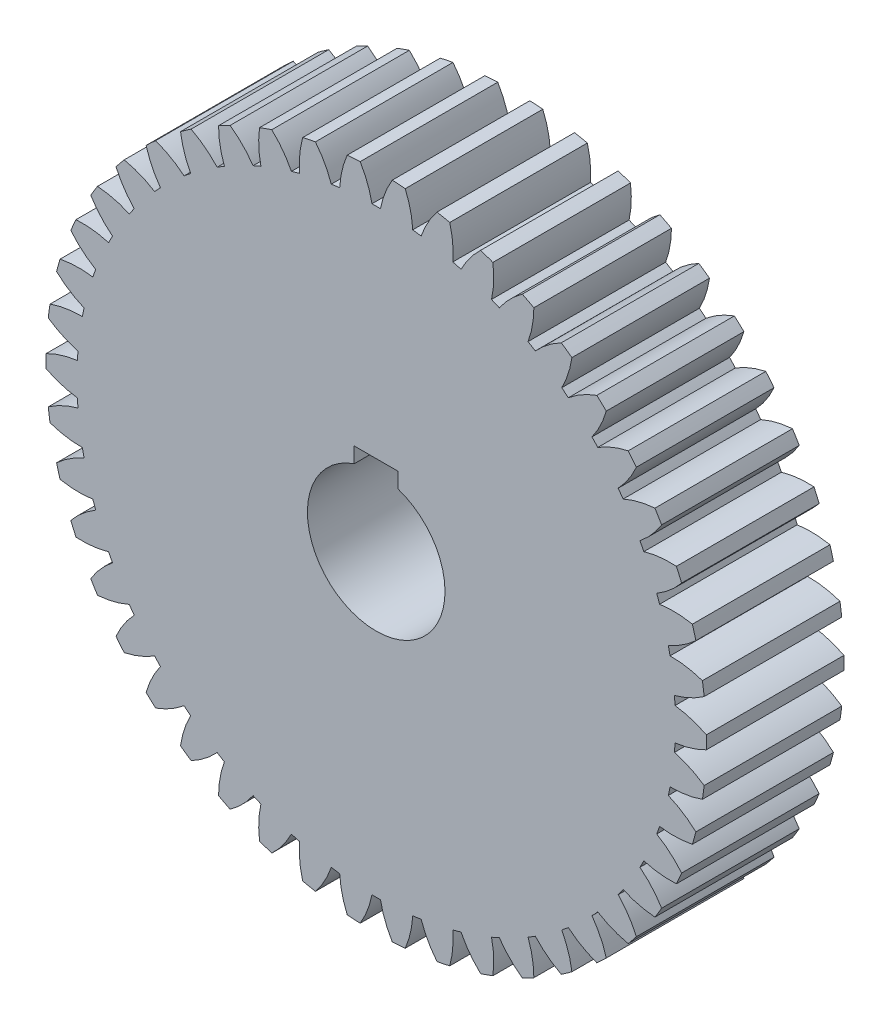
from build123d import *

# Parameters (mm, degrees)
SKETCH1_R           = 120
BOSS_EXTRUDE1_DEPTH = 50
CUT_EXTRUDE1_REACH  = 178.918
CIRPATTERN1_COUNT   = 46
CUT_EXTRUDE2_DEPTH  = 50


with BuildPart() as part:
    # Sketch1 → Boss-Extrude1 (new body)
    with BuildSketch(Plane.XY):
        Circle(SKETCH1_R)
    extrude(amount=BOSS_EXTRUDE1_DEPTH)

    # Sketch2 → Cut-Extrude1 (cut, up to next)
    with BuildSketch(Plane.XY.offset(50), mode=Mode.PRIVATE) as cut_extrude1_sk1:
        with BuildLine():
            ThreePointArc((1.546521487, 108.738002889), (0, 108.749), (-1.546521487, 108.738002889))
            ThreePointArc((-1.546521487, 108.738002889), (-3.197388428, 114.487285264), (-5.830255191, 119.858283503))
            ThreePointArc((-5.830255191, 119.858283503), (0, 120), (5.830255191, 119.858283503))
            ThreePointArc((5.830255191, 119.858283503), (3.197388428, 114.487285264), (1.546521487, 108.738002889))
        make_face()
    cut_extrude1_tool1 = extrude(cut_extrude1_sk1.sketch, amount=-CUT_EXTRUDE1_REACH, mode=Mode.PRIVATE) & part.part
    cut_extrude1 = cut_extrude1_tool1.solids().sort_by_distance((0, 115.555461, 50))[0]
    add(cut_extrude1, mode=Mode.SUBTRACT)

    # CirPattern1: Cut-Extrude1 ×46 about axis
    cirpattern1_axis = Axis((0, 0, 0), (0, 0, 1))
    for i in range(1, CIRPATTERN1_COUNT):
        add(cut_extrude1.rotate(cirpattern1_axis, i * 360 / CIRPATTERN1_COUNT), mode=Mode.SUBTRACT)

    # Sketch3 → Cut-Extrude2 (cut)
    with BuildSketch(Plane.XY.offset(50)):
        with BuildLine():
            Line((-8, 29.3), (8, 29.3))
            Line((8, 29.3), (8, 23.685438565))
            ThreePointArc((8, 23.685438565), (0, -25), (-8, 23.685438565))
            Line((-8, 23.685438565), (-8, 29.3))
        make_face()
    extrude(amount=-CUT_EXTRUDE2_DEPTH, mode=Mode.SUBTRACT)


solid = part.part
